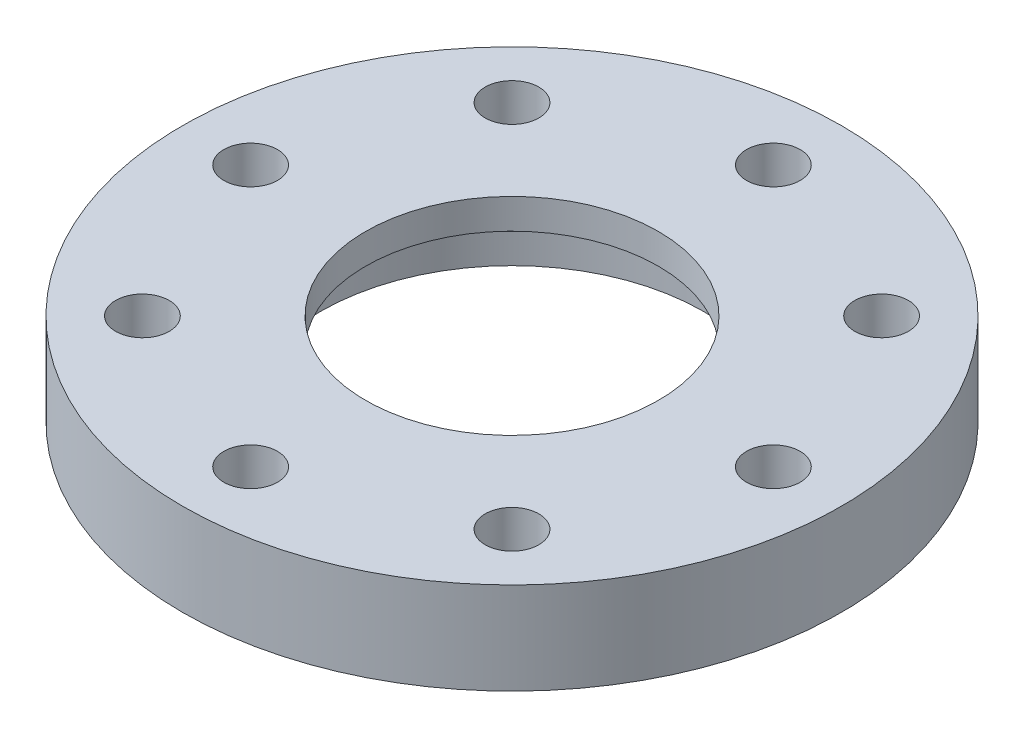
ISO-10303-21;
HEADER;
FILE_DESCRIPTION(('STEP AP214'),'2;1');
FILE_NAME('part.step','',(''),(''),'','','');
FILE_SCHEMA(('AUTOMOTIVE_DESIGN { 1 0 10303 214 1 1 1 1 }'));
ENDSEC;
DATA;
#1=APPLICATION_CONTEXT('core data for automotive mechanical design processes');
#2=APPLICATION_PROTOCOL_DEFINITION('international standard','automotive_design',2000,#1);
#3=PRODUCT_CONTEXT('',#1,'mechanical');
#4=PRODUCT('Part','Part','',(#3));
#5=PRODUCT_RELATED_PRODUCT_CATEGORY('part','',(#4));
#6=PRODUCT_DEFINITION_FORMATION('','',#4);
#7=PRODUCT_DEFINITION_CONTEXT('part definition',#1,'design');
#8=PRODUCT_DEFINITION('design','',#6,#7);
#9=PRODUCT_DEFINITION_SHAPE('','',#8);
#10=(LENGTH_UNIT() NAMED_UNIT(*) SI_UNIT(.MILLI.,.METRE.));
#11=(NAMED_UNIT(*) PLANE_ANGLE_UNIT() SI_UNIT($,.RADIAN.));
#12=(NAMED_UNIT(*) SI_UNIT($,.STERADIAN.) SOLID_ANGLE_UNIT());
#13=UNCERTAINTY_MEASURE_WITH_UNIT(LENGTH_MEASURE(1.E-05),#10,'distance_accuracy_value','');
#14=(GEOMETRIC_REPRESENTATION_CONTEXT(3) GLOBAL_UNCERTAINTY_ASSIGNED_CONTEXT((#13)) GLOBAL_UNIT_ASSIGNED_CONTEXT((#10,
#11,#12)) REPRESENTATION_CONTEXT('',''));
#15=CARTESIAN_POINT('',(0.,0.,0.));
#16=DIRECTION('',(0.,0.,1.));
#17=DIRECTION('',(1.,0.,0.));
#18=AXIS2_PLACEMENT_3D('',#15,#16,#17);
#19=CARTESIAN_POINT('',(0.,0.,0.));
#20=DIRECTION('',(0.,-1.,0.));
#21=DIRECTION('',(0.,0.,-1.));
#22=AXIS2_PLACEMENT_3D('',#19,#20,#21);
#23=CYLINDRICAL_SURFACE('',#22,43.);
#24=CARTESIAN_POINT('',(0.,25.6835006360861,0.));
#25=DIRECTION('',(0.,-1.,0.));
#26=DIRECTION('',(0.,0.,-1.));
#27=AXIS2_PLACEMENT_3D('',#24,#25,#26);
#28=CIRCLE('',#27,43.);
#29=CARTESIAN_POINT('',(0.,25.6835006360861,-43.));
#30=VERTEX_POINT('',#29);
#31=EDGE_CURVE('E50',#30,#30,#28,.T.);
#32=ORIENTED_EDGE('',*,*,#31,.F.);
#33=EDGE_LOOP('',(#32));
#34=FACE_BOUND('',#33,.T.);
#35=CARTESIAN_POINT('',(0.,37.6835006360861,0.));
#36=DIRECTION('',(0.,-1.,0.));
#37=DIRECTION('',(0.,0.,-1.));
#38=AXIS2_PLACEMENT_3D('',#35,#36,#37);
#39=CIRCLE('',#38,43.);
#40=CARTESIAN_POINT('',(0.,37.6835006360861,-43.));
#41=VERTEX_POINT('',#40);
#42=EDGE_CURVE('E10',#41,#41,#39,.T.);
#43=ORIENTED_EDGE('',*,*,#42,.T.);
#44=EDGE_LOOP('',(#43));
#45=FACE_BOUND('',#44,.T.);
#46=ADVANCED_FACE('F28',(#34,#45),#23,.T.);
#47=CARTESIAN_POINT('',(-43.,37.6835006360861,0.));
#48=DIRECTION('',(0.,-1.,0.));
#49=DIRECTION('',(0.,0.,-1.));
#50=AXIS2_PLACEMENT_3D('',#47,#48,#49);
#51=PLANE('',#50);
#52=CARTESIAN_POINT('',(-24.112341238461,37.6835006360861,-24.1123412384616));
#53=DIRECTION('',(0.,1.,0.));
#54=DIRECTION('',(0.707106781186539,0.,0.707106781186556));
#55=AXIS2_PLACEMENT_3D('',#52,#53,#54);
#56=CIRCLE('',#55,3.5);
#57=CARTESIAN_POINT('',(-21.6374675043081,37.6835006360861,-21.6374675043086));
#58=VERTEX_POINT('',#57);
#59=EDGE_CURVE('E96',#58,#58,#56,.T.);
#60=ORIENTED_EDGE('',*,*,#59,.F.);
#61=EDGE_LOOP('',(#60));
#62=FACE_BOUND('',#61,.T.);
#63=CARTESIAN_POINT('',(-34.1,37.6835006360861,-3.57178540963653E-13));
#64=DIRECTION('',(0.,1.,0.));
#65=DIRECTION('',(1.,0.,0.));
#66=AXIS2_PLACEMENT_3D('',#63,#64,#65);
#67=CIRCLE('',#66,3.5);
#68=CARTESIAN_POINT('',(-30.6,37.6835006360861,-3.205179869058E-13));
#69=VERTEX_POINT('',#68);
#70=EDGE_CURVE('E90',#69,#69,#67,.T.);
#71=ORIENTED_EDGE('',*,*,#70,.F.);
#72=EDGE_LOOP('',(#71));
#73=FACE_BOUND('',#72,.T.);
#74=CARTESIAN_POINT('',(-24.1123412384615,37.6835006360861,24.1123412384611));
#75=DIRECTION('',(0.,1.,0.));
#76=DIRECTION('',(0.707106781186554,0.,-0.707106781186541));
#77=AXIS2_PLACEMENT_3D('',#74,#75,#76);
#78=CIRCLE('',#77,3.5);
#79=CARTESIAN_POINT('',(-21.6374675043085,37.6835006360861,21.6374675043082));
#80=VERTEX_POINT('',#79);
#81=EDGE_CURVE('E84',#80,#80,#78,.T.);
#82=ORIENTED_EDGE('',*,*,#81,.F.);
#83=EDGE_LOOP('',(#82));
#84=FACE_BOUND('',#83,.T.);
#85=CARTESIAN_POINT('',(0.,37.6835006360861,34.1));
#86=DIRECTION('',(0.,1.,0.));
#87=DIRECTION('',(0.,0.,-1.));
#88=AXIS2_PLACEMENT_3D('',#85,#86,#87);
#89=CIRCLE('',#88,3.5);
#90=CARTESIAN_POINT('',(0.,37.6835006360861,30.6));
#91=VERTEX_POINT('',#90);
#92=EDGE_CURVE('E78',#91,#91,#89,.T.);
#93=ORIENTED_EDGE('',*,*,#92,.F.);
#94=EDGE_LOOP('',(#93));
#95=FACE_BOUND('',#94,.T.);
#96=CARTESIAN_POINT('',(24.1123412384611,37.6835006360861,24.1123412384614));
#97=DIRECTION('',(0.,1.,0.));
#98=DIRECTION('',(-0.707106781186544,0.,-0.707106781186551));
#99=AXIS2_PLACEMENT_3D('',#96,#97,#98);
#100=CIRCLE('',#99,3.5);
#101=CARTESIAN_POINT('',(21.6374675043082,37.6835006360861,21.6374675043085));
#102=VERTEX_POINT('',#101);
#103=EDGE_CURVE('E72',#102,#102,#100,.T.);
#104=ORIENTED_EDGE('',*,*,#103,.F.);
#105=EDGE_LOOP('',(#104));
#106=FACE_BOUND('',#105,.T.);
#107=CARTESIAN_POINT('',(34.1,37.6835006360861,1.19059513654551E-13));
#108=DIRECTION('',(0.,1.,0.));
#109=DIRECTION('',(-1.,0.,0.));
#110=AXIS2_PLACEMENT_3D('',#107,#108,#109);
#111=CIRCLE('',#110,3.5);
#112=CARTESIAN_POINT('',(30.6,37.6835006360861,1.068393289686E-13));
#113=VERTEX_POINT('',#112);
#114=EDGE_CURVE('E66',#113,#113,#111,.T.);
#115=ORIENTED_EDGE('',*,*,#114,.F.);
#116=EDGE_LOOP('',(#115));
#117=FACE_BOUND('',#116,.T.);
#118=CARTESIAN_POINT('',(24.1123412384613,37.6835006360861,-24.1123412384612));
#119=DIRECTION('',(0.,1.,0.));
#120=DIRECTION('',(-0.707106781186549,0.,0.707106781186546));
#121=AXIS2_PLACEMENT_3D('',#118,#119,#120);
#122=CIRCLE('',#121,3.5);
#123=CARTESIAN_POINT('',(21.6374675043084,37.6835006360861,-21.6374675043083));
#124=VERTEX_POINT('',#123);
#125=EDGE_CURVE('E60',#124,#124,#122,.T.);
#126=ORIENTED_EDGE('',*,*,#125,.F.);
#127=EDGE_LOOP('',(#126));
#128=FACE_BOUND('',#127,.T.);
#129=CARTESIAN_POINT('',(0.,37.6835006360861,-34.1));
#130=DIRECTION('',(0.,1.,0.));
#131=DIRECTION('',(0.,0.,1.));
#132=AXIS2_PLACEMENT_3D('',#129,#130,#131);
#133=CIRCLE('',#132,3.5);
#134=CARTESIAN_POINT('',(0.,37.6835006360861,-30.6));
#135=VERTEX_POINT('',#134);
#136=EDGE_CURVE('E54',#135,#135,#133,.T.);
#137=ORIENTED_EDGE('',*,*,#136,.F.);
#138=EDGE_LOOP('',(#137));
#139=FACE_BOUND('',#138,.T.);
#140=ORIENTED_EDGE('',*,*,#42,.F.);
#141=EDGE_LOOP('',(#140));
#142=FACE_BOUND('',#141,.T.);
#143=CARTESIAN_POINT('',(0.,37.6835006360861,0.));
#144=DIRECTION('',(0.,-1.,0.));
#145=DIRECTION('',(0.,0.,-1.));
#146=AXIS2_PLACEMENT_3D('',#143,#144,#145);
#147=CIRCLE('',#146,19.1);
#148=CARTESIAN_POINT('',(0.,37.6835006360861,-19.1));
#149=VERTEX_POINT('',#148);
#150=EDGE_CURVE('E34',#149,#149,#147,.T.);
#151=ORIENTED_EDGE('',*,*,#150,.T.);
#152=EDGE_LOOP('',(#151));
#153=FACE_BOUND('',#152,.T.);
#154=ADVANCED_FACE('F112',(#62,#73,#84,#95,#106,#117,#128,#139,#142,#153),#51,.F.);
#155=CARTESIAN_POINT('',(0.,0.,0.));
#156=DIRECTION('',(0.,-1.,0.));
#157=DIRECTION('',(0.,0.,-1.));
#158=AXIS2_PLACEMENT_3D('',#155,#156,#157);
#159=CYLINDRICAL_SURFACE('',#158,19.1);
#160=ORIENTED_EDGE('',*,*,#150,.F.);
#161=EDGE_LOOP('',(#160));
#162=FACE_BOUND('',#161,.T.);
#163=CARTESIAN_POINT('',(0.,33.7547251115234,0.));
#164=DIRECTION('',(0.,-1.,0.));
#165=DIRECTION('',(0.,0.,-1.));
#166=AXIS2_PLACEMENT_3D('',#163,#164,#165);
#167=CIRCLE('',#166,19.1);
#168=CARTESIAN_POINT('',(0.,33.7547251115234,-19.1));
#169=VERTEX_POINT('',#168);
#170=EDGE_CURVE('E38',#169,#169,#167,.T.);
#171=ORIENTED_EDGE('',*,*,#170,.T.);
#172=EDGE_LOOP('',(#171));
#173=FACE_BOUND('',#172,.T.);
#174=ADVANCED_FACE('F115',(#162,#173),#159,.F.);
#175=CARTESIAN_POINT('',(0.,29.6235006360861,0.));
#176=DIRECTION('',(0.,-1.,0.));
#177=DIRECTION('',(0.,0.,-1.));
#178=AXIS2_PLACEMENT_3D('',#175,#176,#177);
#179=CONICAL_SURFACE('',#178,25.,0.959931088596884);
#180=ORIENTED_EDGE('',*,*,#170,.F.);
#181=EDGE_LOOP('',(#180));
#182=FACE_BOUND('',#181,.T.);
#183=CARTESIAN_POINT('',(0.,29.6235006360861,0.));
#184=DIRECTION('',(0.,-1.,0.));
#185=DIRECTION('',(0.,0.,-1.));
#186=AXIS2_PLACEMENT_3D('',#183,#184,#185);
#187=CIRCLE('',#186,25.);
#188=CARTESIAN_POINT('',(0.,29.6235006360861,-25.));
#189=VERTEX_POINT('',#188);
#190=EDGE_CURVE('E42',#189,#189,#187,.T.);
#191=ORIENTED_EDGE('',*,*,#190,.T.);
#192=EDGE_LOOP('',(#191));
#193=FACE_BOUND('',#192,.T.);
#194=ADVANCED_FACE('F163',(#182,#193),#179,.F.);
#195=CARTESIAN_POINT('',(0.,0.,0.));
#196=DIRECTION('',(0.,-1.,0.));
#197=DIRECTION('',(0.,0.,-1.));
#198=AXIS2_PLACEMENT_3D('',#195,#196,#197);
#199=CYLINDRICAL_SURFACE('',#198,25.);
#200=ORIENTED_EDGE('',*,*,#190,.F.);
#201=EDGE_LOOP('',(#200));
#202=FACE_BOUND('',#201,.T.);
#203=CARTESIAN_POINT('',(0.,25.6835006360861,0.));
#204=DIRECTION('',(0.,-1.,0.));
#205=DIRECTION('',(0.,0.,-1.));
#206=AXIS2_PLACEMENT_3D('',#203,#204,#205);
#207=CIRCLE('',#206,25.);
#208=CARTESIAN_POINT('',(0.,25.6835006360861,-25.));
#209=VERTEX_POINT('',#208);
#210=EDGE_CURVE('E47',#209,#209,#207,.T.);
#211=ORIENTED_EDGE('',*,*,#210,.T.);
#212=EDGE_LOOP('',(#211));
#213=FACE_BOUND('',#212,.T.);
#214=ADVANCED_FACE('F143',(#202,#213),#199,.F.);
#215=CARTESIAN_POINT('',(-25.,25.6835006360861,0.));
#216=DIRECTION('',(0.,1.,0.));
#217=DIRECTION('',(0.,0.,1.));
#218=AXIS2_PLACEMENT_3D('',#215,#216,#217);
#219=PLANE('',#218);
#220=CARTESIAN_POINT('',(-24.112341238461,25.6835006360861,-24.1123412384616));
#221=DIRECTION('',(0.,1.,0.));
#222=DIRECTION('',(0.707106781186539,0.,0.707106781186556));
#223=AXIS2_PLACEMENT_3D('',#220,#221,#222);
#224=CIRCLE('',#223,3.5);
#225=CARTESIAN_POINT('',(-21.6374675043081,25.6835006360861,-21.6374675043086));
#226=VERTEX_POINT('',#225);
#227=EDGE_CURVE('E93',#226,#226,#224,.T.);
#228=ORIENTED_EDGE('',*,*,#227,.T.);
#229=EDGE_LOOP('',(#228));
#230=FACE_BOUND('',#229,.T.);
#231=CARTESIAN_POINT('',(-34.1,25.6835006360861,-3.57178540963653E-13));
#232=DIRECTION('',(0.,1.,0.));
#233=DIRECTION('',(1.,0.,0.));
#234=AXIS2_PLACEMENT_3D('',#231,#232,#233);
#235=CIRCLE('',#234,3.5);
#236=CARTESIAN_POINT('',(-30.6,25.6835006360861,-3.205179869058E-13));
#237=VERTEX_POINT('',#236);
#238=EDGE_CURVE('E87',#237,#237,#235,.T.);
#239=ORIENTED_EDGE('',*,*,#238,.T.);
#240=EDGE_LOOP('',(#239));
#241=FACE_BOUND('',#240,.T.);
#242=CARTESIAN_POINT('',(-24.1123412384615,25.6835006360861,24.1123412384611));
#243=DIRECTION('',(0.,1.,0.));
#244=DIRECTION('',(0.707106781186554,0.,-0.707106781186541));
#245=AXIS2_PLACEMENT_3D('',#242,#243,#244);
#246=CIRCLE('',#245,3.5);
#247=CARTESIAN_POINT('',(-21.6374675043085,25.6835006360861,21.6374675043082));
#248=VERTEX_POINT('',#247);
#249=EDGE_CURVE('E81',#248,#248,#246,.T.);
#250=ORIENTED_EDGE('',*,*,#249,.T.);
#251=EDGE_LOOP('',(#250));
#252=FACE_BOUND('',#251,.T.);
#253=CARTESIAN_POINT('',(0.,25.6835006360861,34.1));
#254=DIRECTION('',(0.,1.,0.));
#255=DIRECTION('',(0.,0.,-1.));
#256=AXIS2_PLACEMENT_3D('',#253,#254,#255);
#257=CIRCLE('',#256,3.5);
#258=CARTESIAN_POINT('',(0.,25.6835006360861,30.6));
#259=VERTEX_POINT('',#258);
#260=EDGE_CURVE('E75',#259,#259,#257,.T.);
#261=ORIENTED_EDGE('',*,*,#260,.T.);
#262=EDGE_LOOP('',(#261));
#263=FACE_BOUND('',#262,.T.);
#264=CARTESIAN_POINT('',(24.1123412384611,25.6835006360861,24.1123412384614));
#265=DIRECTION('',(0.,1.,0.));
#266=DIRECTION('',(-0.707106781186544,0.,-0.707106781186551));
#267=AXIS2_PLACEMENT_3D('',#264,#265,#266);
#268=CIRCLE('',#267,3.5);
#269=CARTESIAN_POINT('',(21.6374675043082,25.6835006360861,21.6374675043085));
#270=VERTEX_POINT('',#269);
#271=EDGE_CURVE('E69',#270,#270,#268,.T.);
#272=ORIENTED_EDGE('',*,*,#271,.T.);
#273=EDGE_LOOP('',(#272));
#274=FACE_BOUND('',#273,.T.);
#275=CARTESIAN_POINT('',(34.1,25.6835006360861,1.19059513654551E-13));
#276=DIRECTION('',(0.,1.,0.));
#277=DIRECTION('',(-1.,0.,0.));
#278=AXIS2_PLACEMENT_3D('',#275,#276,#277);
#279=CIRCLE('',#278,3.5);
#280=CARTESIAN_POINT('',(30.6,25.6835006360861,1.068393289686E-13));
#281=VERTEX_POINT('',#280);
#282=EDGE_CURVE('E63',#281,#281,#279,.T.);
#283=ORIENTED_EDGE('',*,*,#282,.T.);
#284=EDGE_LOOP('',(#283));
#285=FACE_BOUND('',#284,.T.);
#286=CARTESIAN_POINT('',(24.1123412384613,25.6835006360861,-24.1123412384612));
#287=DIRECTION('',(0.,1.,0.));
#288=DIRECTION('',(-0.707106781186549,0.,0.707106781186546));
#289=AXIS2_PLACEMENT_3D('',#286,#287,#288);
#290=CIRCLE('',#289,3.5);
#291=CARTESIAN_POINT('',(21.6374675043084,25.6835006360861,-21.6374675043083));
#292=VERTEX_POINT('',#291);
#293=EDGE_CURVE('E57',#292,#292,#290,.T.);
#294=ORIENTED_EDGE('',*,*,#293,.T.);
#295=EDGE_LOOP('',(#294));
#296=FACE_BOUND('',#295,.T.);
#297=CARTESIAN_POINT('',(0.,25.6835006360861,-34.1));
#298=DIRECTION('',(0.,1.,0.));
#299=DIRECTION('',(0.,0.,1.));
#300=AXIS2_PLACEMENT_3D('',#297,#298,#299);
#301=CIRCLE('',#300,3.5);
#302=CARTESIAN_POINT('',(0.,25.6835006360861,-30.6));
#303=VERTEX_POINT('',#302);
#304=EDGE_CURVE('E53',#303,#303,#301,.T.);
#305=ORIENTED_EDGE('',*,*,#304,.T.);
#306=EDGE_LOOP('',(#305));
#307=FACE_BOUND('',#306,.T.);
#308=ORIENTED_EDGE('',*,*,#210,.F.);
#309=EDGE_LOOP('',(#308));
#310=FACE_BOUND('',#309,.T.);
#311=ORIENTED_EDGE('',*,*,#31,.T.);
#312=EDGE_LOOP('',(#311));
#313=FACE_BOUND('',#312,.T.);
#314=ADVANCED_FACE('F102',(#230,#241,#252,#263,#274,#285,#296,#307,#310,#313),#219,.F.);
#315=CARTESIAN_POINT('',(0.,25.6835006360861,-34.1));
#316=DIRECTION('',(0.,1.,0.));
#317=DIRECTION('',(0.,0.,1.));
#318=AXIS2_PLACEMENT_3D('',#315,#316,#317);
#319=CYLINDRICAL_SURFACE('',#318,3.5);
#320=ORIENTED_EDGE('',*,*,#304,.F.);
#321=EDGE_LOOP('',(#320));
#322=FACE_BOUND('',#321,.T.);
#323=ORIENTED_EDGE('',*,*,#136,.T.);
#324=EDGE_LOOP('',(#323));
#325=FACE_BOUND('',#324,.T.);
#326=ADVANCED_FACE('F131',(#322,#325),#319,.F.);
#327=CARTESIAN_POINT('',(24.1123412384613,25.6835006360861,-24.1123412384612));
#328=DIRECTION('',(0.,1.,0.));
#329=DIRECTION('',(0.,0.,1.));
#330=AXIS2_PLACEMENT_3D('',#327,#328,#329);
#331=CYLINDRICAL_SURFACE('',#330,3.5);
#332=ORIENTED_EDGE('',*,*,#293,.F.);
#333=EDGE_LOOP('',(#332));
#334=FACE_BOUND('',#333,.T.);
#335=ORIENTED_EDGE('',*,*,#125,.T.);
#336=EDGE_LOOP('',(#335));
#337=FACE_BOUND('',#336,.T.);
#338=ADVANCED_FACE('F133',(#334,#337),#331,.F.);
#339=CARTESIAN_POINT('',(34.1,25.6835006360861,1.19059513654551E-13));
#340=DIRECTION('',(0.,1.,0.));
#341=DIRECTION('',(0.,0.,1.));
#342=AXIS2_PLACEMENT_3D('',#339,#340,#341);
#343=CYLINDRICAL_SURFACE('',#342,3.5);
#344=ORIENTED_EDGE('',*,*,#282,.F.);
#345=EDGE_LOOP('',(#344));
#346=FACE_BOUND('',#345,.T.);
#347=ORIENTED_EDGE('',*,*,#114,.T.);
#348=EDGE_LOOP('',(#347));
#349=FACE_BOUND('',#348,.T.);
#350=ADVANCED_FACE('F140',(#346,#349),#343,.F.);
#351=CARTESIAN_POINT('',(24.1123412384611,25.6835006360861,24.1123412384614));
#352=DIRECTION('',(0.,1.,0.));
#353=DIRECTION('',(0.,0.,1.));
#354=AXIS2_PLACEMENT_3D('',#351,#352,#353);
#355=CYLINDRICAL_SURFACE('',#354,3.5);
#356=ORIENTED_EDGE('',*,*,#271,.F.);
#357=EDGE_LOOP('',(#356));
#358=FACE_BOUND('',#357,.T.);
#359=ORIENTED_EDGE('',*,*,#103,.T.);
#360=EDGE_LOOP('',(#359));
#361=FACE_BOUND('',#360,.T.);
#362=ADVANCED_FACE('F198',(#358,#361),#355,.F.);
#363=CARTESIAN_POINT('',(0.,25.6835006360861,34.1));
#364=DIRECTION('',(0.,1.,0.));
#365=DIRECTION('',(0.,0.,1.));
#366=AXIS2_PLACEMENT_3D('',#363,#364,#365);
#367=CYLINDRICAL_SURFACE('',#366,3.5);
#368=ORIENTED_EDGE('',*,*,#260,.F.);
#369=EDGE_LOOP('',(#368));
#370=FACE_BOUND('',#369,.T.);
#371=ORIENTED_EDGE('',*,*,#92,.T.);
#372=EDGE_LOOP('',(#371));
#373=FACE_BOUND('',#372,.T.);
#374=ADVANCED_FACE('F208',(#370,#373),#367,.F.);
#375=CARTESIAN_POINT('',(-24.1123412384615,25.6835006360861,24.1123412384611));
#376=DIRECTION('',(0.,1.,0.));
#377=DIRECTION('',(0.,0.,1.));
#378=AXIS2_PLACEMENT_3D('',#375,#376,#377);
#379=CYLINDRICAL_SURFACE('',#378,3.5);
#380=ORIENTED_EDGE('',*,*,#249,.F.);
#381=EDGE_LOOP('',(#380));
#382=FACE_BOUND('',#381,.T.);
#383=ORIENTED_EDGE('',*,*,#81,.T.);
#384=EDGE_LOOP('',(#383));
#385=FACE_BOUND('',#384,.T.);
#386=ADVANCED_FACE('F218',(#382,#385),#379,.F.);
#387=CARTESIAN_POINT('',(-34.1,25.6835006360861,-3.57178540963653E-13));
#388=DIRECTION('',(0.,1.,0.));
#389=DIRECTION('',(0.,0.,1.));
#390=AXIS2_PLACEMENT_3D('',#387,#388,#389);
#391=CYLINDRICAL_SURFACE('',#390,3.5);
#392=ORIENTED_EDGE('',*,*,#238,.F.);
#393=EDGE_LOOP('',(#392));
#394=FACE_BOUND('',#393,.T.);
#395=ORIENTED_EDGE('',*,*,#70,.T.);
#396=EDGE_LOOP('',(#395));
#397=FACE_BOUND('',#396,.T.);
#398=ADVANCED_FACE('F108',(#394,#397),#391,.F.);
#399=CARTESIAN_POINT('',(-24.112341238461,25.6835006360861,-24.1123412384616));
#400=DIRECTION('',(0.,1.,0.));
#401=DIRECTION('',(0.,0.,1.));
#402=AXIS2_PLACEMENT_3D('',#399,#400,#401);
#403=CYLINDRICAL_SURFACE('',#402,3.5);
#404=ORIENTED_EDGE('',*,*,#227,.F.);
#405=EDGE_LOOP('',(#404));
#406=FACE_BOUND('',#405,.T.);
#407=ORIENTED_EDGE('',*,*,#59,.T.);
#408=EDGE_LOOP('',(#407));
#409=FACE_BOUND('',#408,.T.);
#410=ADVANCED_FACE('F105',(#406,#409),#403,.F.);
#411=CLOSED_SHELL('',(#46,#154,#174,#194,#214,#314,#326,#338,#350,#362,#374,#386,#398,#410));
#412=MANIFOLD_SOLID_BREP('B2',#411);
#413=ADVANCED_BREP_SHAPE_REPRESENTATION('',(#18,#412),#14);
#414=SHAPE_DEFINITION_REPRESENTATION(#9,#413);
ENDSEC;
END-ISO-10303-21;
